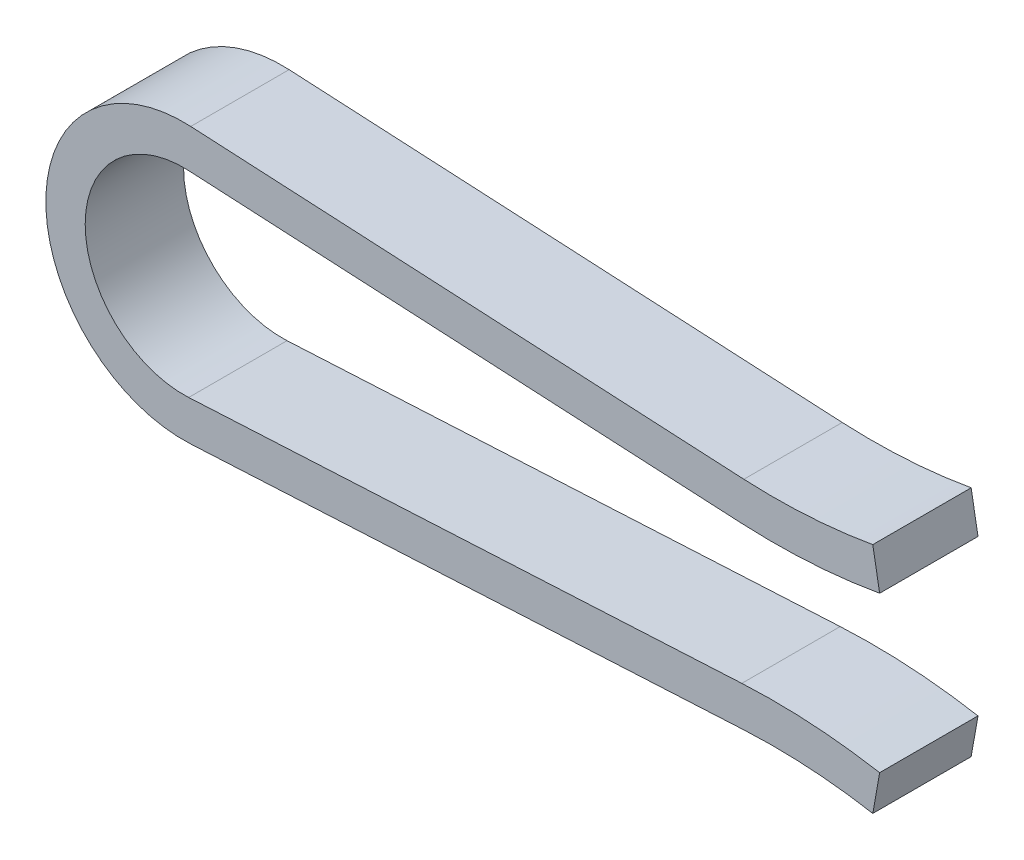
from build123d import *

# Parameters (mm, degrees)
SKETCH2_W = 5
SKETCH2_H = 2


with BuildPart() as part:
    # Sweep1: sweep along a path in Sketch1
    with BuildLine(Plane.XY) as sweep1_path:
        ThreePointArc((35.20944533, 4.932938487), (31.831456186, 4.533127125), (28.429921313, 4.518285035))
        Line((28.429921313, 4.518285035), (0.314015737, 5.991777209))
        ThreePointArc((0.314015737, 5.991777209), (-6, 0), (0.314015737, -5.991777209))
        Line((0.314015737, -5.991777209), (28.429921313, -4.518285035))
        ThreePointArc((28.429921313, -4.518285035), (31.831456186, -4.533127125), (35.20944533, -4.932938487))
    # Sketch2 → Sweep1 (sweep)
    with BuildSketch(Plane(origin=(35.20944533, -4.932938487, 0), x_dir=(0, 0, -1), z_dir=(0.984807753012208, -0.17364817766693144, 0))):
        Rectangle(SKETCH2_W, SKETCH2_H)
    sweep(path=sweep1_path.line)


solid = part.part
